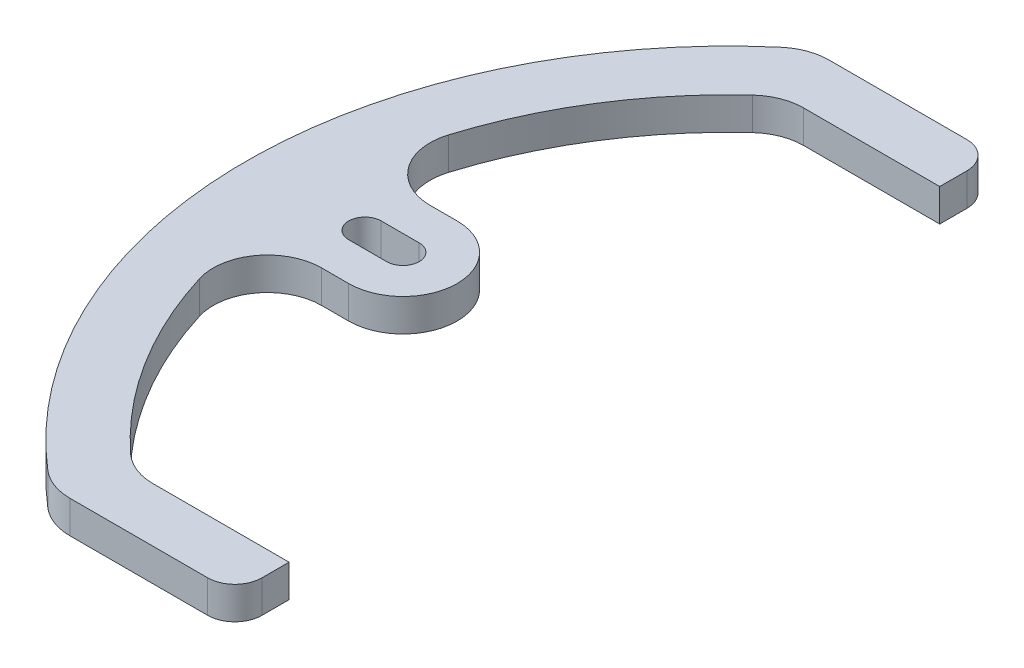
ISO-10303-21;
HEADER;
FILE_DESCRIPTION(('STEP AP214'),'2;1');
FILE_NAME('part.step','',(''),(''),'','','');
FILE_SCHEMA(('AUTOMOTIVE_DESIGN { 1 0 10303 214 1 1 1 1 }'));
ENDSEC;
DATA;
#1=APPLICATION_CONTEXT('core data for automotive mechanical design processes');
#2=APPLICATION_PROTOCOL_DEFINITION('international standard','automotive_design',2000,#1);
#3=PRODUCT_CONTEXT('',#1,'mechanical');
#4=PRODUCT('Part','Part','',(#3));
#5=PRODUCT_RELATED_PRODUCT_CATEGORY('part','',(#4));
#6=PRODUCT_DEFINITION_FORMATION('','',#4);
#7=PRODUCT_DEFINITION_CONTEXT('part definition',#1,'design');
#8=PRODUCT_DEFINITION('design','',#6,#7);
#9=PRODUCT_DEFINITION_SHAPE('','',#8);
#10=(LENGTH_UNIT() NAMED_UNIT(*) SI_UNIT(.MILLI.,.METRE.));
#11=(NAMED_UNIT(*) PLANE_ANGLE_UNIT() SI_UNIT($,.RADIAN.));
#12=(NAMED_UNIT(*) SI_UNIT($,.STERADIAN.) SOLID_ANGLE_UNIT());
#13=UNCERTAINTY_MEASURE_WITH_UNIT(LENGTH_MEASURE(1.E-05),#10,'distance_accuracy_value','');
#14=(GEOMETRIC_REPRESENTATION_CONTEXT(3) GLOBAL_UNCERTAINTY_ASSIGNED_CONTEXT((#13)) GLOBAL_UNIT_ASSIGNED_CONTEXT((#10,
#11,#12)) REPRESENTATION_CONTEXT('',''));
#15=CARTESIAN_POINT('',(0.,0.,0.));
#16=DIRECTION('',(0.,0.,1.));
#17=DIRECTION('',(1.,0.,0.));
#18=AXIS2_PLACEMENT_3D('',#15,#16,#17);
#19=CARTESIAN_POINT('',(-75.,6.,0.));
#20=DIRECTION('',(0.,1.,0.));
#21=DIRECTION('',(0.,0.,1.));
#22=AXIS2_PLACEMENT_3D('',#19,#20,#21);
#23=PLANE('',#22);
#24=CARTESIAN_POINT('',(-75.,6.,0.));
#25=DIRECTION('',(0.,1.,0.));
#26=DIRECTION('',(0.,0.,1.));
#27=AXIS2_PLACEMENT_3D('',#24,#25,#26);
#28=CIRCLE('',#27,9.99999999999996);
#29=CARTESIAN_POINT('',(-75.,6.,9.99999999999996));
#30=VERTEX_POINT('',#29);
#31=CARTESIAN_POINT('',(-75.,6.,-9.99999999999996));
#32=VERTEX_POINT('',#31);
#33=EDGE_CURVE('E274',#30,#32,#28,.T.);
#34=ORIENTED_EDGE('',*,*,#33,.T.);
#35=DIRECTION('',(-1.,0.,0.));
#36=VECTOR('',#35,1.);
#37=CARTESIAN_POINT('',(-75.,6.,-9.99999999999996));
#38=LINE('',#37,#36);
#39=CARTESIAN_POINT('',(-79.9923072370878,6.,-9.99999999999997));
#40=VERTEX_POINT('',#39);
#41=EDGE_CURVE('E277',#32,#40,#38,.T.);
#42=ORIENTED_EDGE('',*,*,#41,.T.);
#43=CARTESIAN_POINT('',(-79.9923072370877,6.,-20.));
#44=DIRECTION('',(0.,-1.,0.));
#45=DIRECTION('',(0.,0.,1.));
#46=AXIS2_PLACEMENT_3D('',#43,#44,#45);
#47=CIRCLE('',#46,10.);
#48=CARTESIAN_POINT('',(-89.5499994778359,6.,-22.9411764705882));
#49=VERTEX_POINT('',#48);
#50=EDGE_CURVE('E279',#40,#49,#47,.T.);
#51=ORIENTED_EDGE('',*,*,#50,.T.);
#52=CARTESIAN_POINT('',(-15.,6.,0.));
#53=DIRECTION('',(0.,-1.,0.));
#54=DIRECTION('',(0.,0.,-1.));
#55=AXIS2_PLACEMENT_3D('',#52,#53,#54);
#56=CIRCLE('',#55,78.);
#57=CARTESIAN_POINT('',(-67.8643560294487,6.,-57.3529411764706));
#58=VERTEX_POINT('',#57);
#59=EDGE_CURVE('E281',#49,#58,#56,.T.);
#60=ORIENTED_EDGE('',*,*,#59,.T.);
#61=CARTESIAN_POINT('',(-61.0868744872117,6.,-50.));
#62=DIRECTION('',(0.,-1.,0.));
#63=DIRECTION('',(0.,0.,-1.));
#64=AXIS2_PLACEMENT_3D('',#61,#62,#63);
#65=CIRCLE('',#64,10.);
#66=CARTESIAN_POINT('',(-61.0868744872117,6.,-60.));
#67=VERTEX_POINT('',#66);
#68=EDGE_CURVE('E283',#58,#67,#65,.T.);
#69=ORIENTED_EDGE('',*,*,#68,.T.);
#70=DIRECTION('',(1.,0.,0.));
#71=VECTOR('',#70,1.);
#72=CARTESIAN_POINT('',(-61.0868744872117,6.,-60.));
#73=LINE('',#72,#71);
#74=CARTESIAN_POINT('',(-36.,6.,-60.));
#75=VERTEX_POINT('',#74);
#76=EDGE_CURVE('E285',#67,#75,#73,.T.);
#77=ORIENTED_EDGE('',*,*,#76,.T.);
#78=DIRECTION('',(0.,0.,-1.));
#79=VECTOR('',#78,1.);
#80=CARTESIAN_POINT('',(-36.,6.,-60.));
#81=LINE('',#80,#79);
#82=CARTESIAN_POINT('',(-36.,6.,-65.));
#83=VERTEX_POINT('',#82);
#84=EDGE_CURVE('E287',#75,#83,#81,.T.);
#85=ORIENTED_EDGE('',*,*,#84,.T.);
#86=CARTESIAN_POINT('',(-41.,6.,-65.));
#87=DIRECTION('',(0.,1.,0.));
#88=DIRECTION('',(0.,0.,-1.));
#89=AXIS2_PLACEMENT_3D('',#86,#87,#88);
#90=CIRCLE('',#89,5.);
#91=CARTESIAN_POINT('',(-41.,6.,-70.));
#92=VERTEX_POINT('',#91);
#93=EDGE_CURVE('E289',#83,#92,#90,.T.);
#94=ORIENTED_EDGE('',*,*,#93,.T.);
#95=DIRECTION('',(-1.,0.,0.));
#96=VECTOR('',#95,1.);
#97=CARTESIAN_POINT('',(-66.3906606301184,6.,-70.));
#98=LINE('',#97,#96);
#99=CARTESIAN_POINT('',(-66.3906606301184,6.,-70.));
#100=VERTEX_POINT('',#99);
#101=EDGE_CURVE('E291',#92,#100,#98,.T.);
#102=ORIENTED_EDGE('',*,*,#101,.T.);
#103=CARTESIAN_POINT('',(-66.3906606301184,6.,-60.));
#104=DIRECTION('',(0.,1.,0.));
#105=DIRECTION('',(0.,0.,1.));
#106=AXIS2_PLACEMENT_3D('',#103,#104,#105);
#107=CIRCLE('',#106,10.);
#108=CARTESIAN_POINT('',(-72.8958075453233,6.,-67.5949367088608));
#109=VERTEX_POINT('',#108);
#110=EDGE_CURVE('E293',#100,#109,#107,.T.);
#111=ORIENTED_EDGE('',*,*,#110,.T.);
#112=CARTESIAN_POINT('',(-15.,6.,0.));
#113=DIRECTION('',(0.,1.,0.));
#114=DIRECTION('',(0.,0.,1.));
#115=AXIS2_PLACEMENT_3D('',#112,#113,#114);
#116=CIRCLE('',#115,89.0000000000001);
#117=CARTESIAN_POINT('',(-72.8958075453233,6.,67.5949367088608));
#118=VERTEX_POINT('',#117);
#119=EDGE_CURVE('E295',#109,#118,#116,.T.);
#120=ORIENTED_EDGE('',*,*,#119,.T.);
#121=CARTESIAN_POINT('',(-66.3906606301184,6.,60.));
#122=DIRECTION('',(0.,1.,0.));
#123=DIRECTION('',(0.,0.,-1.));
#124=AXIS2_PLACEMENT_3D('',#121,#122,#123);
#125=CIRCLE('',#124,10.);
#126=CARTESIAN_POINT('',(-66.3906606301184,6.,70.));
#127=VERTEX_POINT('',#126);
#128=EDGE_CURVE('E297',#118,#127,#125,.T.);
#129=ORIENTED_EDGE('',*,*,#128,.T.);
#130=DIRECTION('',(1.,0.,0.));
#131=VECTOR('',#130,1.);
#132=CARTESIAN_POINT('',(-66.3906606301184,6.,70.));
#133=LINE('',#132,#131);
#134=CARTESIAN_POINT('',(-41.,6.,70.));
#135=VERTEX_POINT('',#134);
#136=EDGE_CURVE('E299',#127,#135,#133,.T.);
#137=ORIENTED_EDGE('',*,*,#136,.T.);
#138=CARTESIAN_POINT('',(-41.,6.,65.));
#139=DIRECTION('',(0.,1.,0.));
#140=DIRECTION('',(0.,0.,1.));
#141=AXIS2_PLACEMENT_3D('',#138,#139,#140);
#142=CIRCLE('',#141,5.);
#143=CARTESIAN_POINT('',(-36.,6.,65.));
#144=VERTEX_POINT('',#143);
#145=EDGE_CURVE('E301',#135,#144,#142,.T.);
#146=ORIENTED_EDGE('',*,*,#145,.T.);
#147=DIRECTION('',(0.,0.,-1.));
#148=VECTOR('',#147,1.);
#149=CARTESIAN_POINT('',(-36.,6.,60.));
#150=LINE('',#149,#148);
#151=CARTESIAN_POINT('',(-36.,6.,60.));
#152=VERTEX_POINT('',#151);
#153=EDGE_CURVE('E303',#144,#152,#150,.T.);
#154=ORIENTED_EDGE('',*,*,#153,.T.);
#155=DIRECTION('',(-1.,0.,0.));
#156=VECTOR('',#155,1.);
#157=CARTESIAN_POINT('',(-61.0868744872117,6.,60.));
#158=LINE('',#157,#156);
#159=CARTESIAN_POINT('',(-61.0868744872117,6.,60.));
#160=VERTEX_POINT('',#159);
#161=EDGE_CURVE('E305',#152,#160,#158,.T.);
#162=ORIENTED_EDGE('',*,*,#161,.T.);
#163=CARTESIAN_POINT('',(-61.0868744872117,6.,50.));
#164=DIRECTION('',(0.,-1.,0.));
#165=DIRECTION('',(0.,0.,1.));
#166=AXIS2_PLACEMENT_3D('',#163,#164,#165);
#167=CIRCLE('',#166,10.);
#168=CARTESIAN_POINT('',(-67.8643560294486,6.,57.3529411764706));
#169=VERTEX_POINT('',#168);
#170=EDGE_CURVE('E307',#160,#169,#167,.T.);
#171=ORIENTED_EDGE('',*,*,#170,.T.);
#172=CARTESIAN_POINT('',(-15.,6.,0.));
#173=DIRECTION('',(0.,-1.,0.));
#174=DIRECTION('',(0.,0.,1.));
#175=AXIS2_PLACEMENT_3D('',#172,#173,#174);
#176=CIRCLE('',#175,78.);
#177=CARTESIAN_POINT('',(-89.5499994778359,6.,22.9411764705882));
#178=VERTEX_POINT('',#177);
#179=EDGE_CURVE('E309',#169,#178,#176,.T.);
#180=ORIENTED_EDGE('',*,*,#179,.T.);
#181=CARTESIAN_POINT('',(-79.9923072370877,6.,20.));
#182=DIRECTION('',(0.,-1.,0.));
#183=DIRECTION('',(0.,0.,-1.));
#184=AXIS2_PLACEMENT_3D('',#181,#182,#183);
#185=CIRCLE('',#184,10.);
#186=CARTESIAN_POINT('',(-79.9923072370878,6.,9.99999999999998));
#187=VERTEX_POINT('',#186);
#188=EDGE_CURVE('E311',#178,#187,#185,.T.);
#189=ORIENTED_EDGE('',*,*,#188,.T.);
#190=DIRECTION('',(1.,0.,0.));
#191=VECTOR('',#190,1.);
#192=CARTESIAN_POINT('',(-75.,6.,9.99999999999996));
#193=LINE('',#192,#191);
#194=EDGE_CURVE('E313',#187,#30,#193,.T.);
#195=ORIENTED_EDGE('',*,*,#194,.T.);
#196=EDGE_LOOP('',(#34,#42,#51,#60,#69,#77,#85,#94,#102,#111,#120,#129,#137,#146,#154,#162,#171,
#180,#189,#195));
#197=FACE_BOUND('',#196,.T.);
#198=DIRECTION('',(-1.,0.,0.));
#199=VECTOR('',#198,1.);
#200=CARTESIAN_POINT('',(-82.,6.,-3.00000000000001));
#201=LINE('',#200,#199);
#202=CARTESIAN_POINT('',(-75.,6.,-3.00000000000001));
#203=VERTEX_POINT('',#202);
#204=CARTESIAN_POINT('',(-82.,6.,-3.00000000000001));
#205=VERTEX_POINT('',#204);
#206=EDGE_CURVE('E224',#203,#205,#201,.T.);
#207=ORIENTED_EDGE('',*,*,#206,.F.);
#208=CARTESIAN_POINT('',(-75.,6.,0.));
#209=DIRECTION('',(0.,1.,0.));
#210=DIRECTION('',(0.,0.,1.));
#211=AXIS2_PLACEMENT_3D('',#208,#209,#210);
#212=CIRCLE('',#211,3.00000000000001);
#213=CARTESIAN_POINT('',(-75.,6.,3.00000000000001));
#214=VERTEX_POINT('',#213);
#215=EDGE_CURVE('E213',#214,#203,#212,.T.);
#216=ORIENTED_EDGE('',*,*,#215,.F.);
#217=DIRECTION('',(1.,0.,0.));
#218=VECTOR('',#217,1.);
#219=CARTESIAN_POINT('',(-75.,6.,3.00000000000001));
#220=LINE('',#219,#218);
#221=CARTESIAN_POINT('',(-82.,6.,3.00000000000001));
#222=VERTEX_POINT('',#221);
#223=EDGE_CURVE('E228',#222,#214,#220,.T.);
#224=ORIENTED_EDGE('',*,*,#223,.F.);
#225=CARTESIAN_POINT('',(-82.,6.,0.));
#226=DIRECTION('',(0.,1.,0.));
#227=DIRECTION('',(0.,0.,1.));
#228=AXIS2_PLACEMENT_3D('',#225,#226,#227);
#229=CIRCLE('',#228,3.00000000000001);
#230=EDGE_CURVE('E226',#205,#222,#229,.T.);
#231=ORIENTED_EDGE('',*,*,#230,.F.);
#232=EDGE_LOOP('',(#207,#216,#224,#231));
#233=FACE_BOUND('',#232,.T.);
#234=ADVANCED_FACE('F37',(#197,#233),#23,.T.);
#235=CARTESIAN_POINT('',(-75.,0.,0.));
#236=DIRECTION('',(0.,1.,0.));
#237=DIRECTION('',(0.,0.,1.));
#238=AXIS2_PLACEMENT_3D('',#235,#236,#237);
#239=PLANE('',#238);
#240=CARTESIAN_POINT('',(-75.,0.,0.));
#241=DIRECTION('',(0.,1.,0.));
#242=DIRECTION('',(0.,0.,1.));
#243=AXIS2_PLACEMENT_3D('',#240,#241,#242);
#244=CIRCLE('',#243,9.99999999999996);
#245=CARTESIAN_POINT('',(-75.,0.,9.99999999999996));
#246=VERTEX_POINT('',#245);
#247=CARTESIAN_POINT('',(-75.,0.,-9.99999999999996));
#248=VERTEX_POINT('',#247);
#249=EDGE_CURVE('E214',#246,#248,#244,.T.);
#250=ORIENTED_EDGE('',*,*,#249,.F.);
#251=DIRECTION('',(1.,0.,0.));
#252=VECTOR('',#251,1.);
#253=CARTESIAN_POINT('',(-75.,0.,9.99999999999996));
#254=LINE('',#253,#252);
#255=CARTESIAN_POINT('',(-79.9923072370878,0.,9.99999999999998));
#256=VERTEX_POINT('',#255);
#257=EDGE_CURVE('E272',#256,#246,#254,.T.);
#258=ORIENTED_EDGE('',*,*,#257,.F.);
#259=CARTESIAN_POINT('',(-79.9923072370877,0.,20.));
#260=DIRECTION('',(0.,-1.,0.));
#261=DIRECTION('',(0.,0.,-1.));
#262=AXIS2_PLACEMENT_3D('',#259,#260,#261);
#263=CIRCLE('',#262,10.);
#264=CARTESIAN_POINT('',(-89.5499994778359,0.,22.9411764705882));
#265=VERTEX_POINT('',#264);
#266=EDGE_CURVE('E270',#265,#256,#263,.T.);
#267=ORIENTED_EDGE('',*,*,#266,.F.);
#268=CARTESIAN_POINT('',(-15.,0.,0.));
#269=DIRECTION('',(0.,-1.,0.));
#270=DIRECTION('',(0.,0.,1.));
#271=AXIS2_PLACEMENT_3D('',#268,#269,#270);
#272=CIRCLE('',#271,78.);
#273=CARTESIAN_POINT('',(-67.8643560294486,0.,57.3529411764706));
#274=VERTEX_POINT('',#273);
#275=EDGE_CURVE('E268',#274,#265,#272,.T.);
#276=ORIENTED_EDGE('',*,*,#275,.F.);
#277=CARTESIAN_POINT('',(-61.0868744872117,0.,50.));
#278=DIRECTION('',(0.,-1.,0.));
#279=DIRECTION('',(0.,0.,1.));
#280=AXIS2_PLACEMENT_3D('',#277,#278,#279);
#281=CIRCLE('',#280,10.);
#282=CARTESIAN_POINT('',(-61.0868744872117,0.,60.));
#283=VERTEX_POINT('',#282);
#284=EDGE_CURVE('E266',#283,#274,#281,.T.);
#285=ORIENTED_EDGE('',*,*,#284,.F.);
#286=DIRECTION('',(-1.,0.,0.));
#287=VECTOR('',#286,1.);
#288=CARTESIAN_POINT('',(-61.0868744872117,0.,60.));
#289=LINE('',#288,#287);
#290=CARTESIAN_POINT('',(-36.,0.,60.));
#291=VERTEX_POINT('',#290);
#292=EDGE_CURVE('E264',#291,#283,#289,.T.);
#293=ORIENTED_EDGE('',*,*,#292,.F.);
#294=DIRECTION('',(0.,0.,-1.));
#295=VECTOR('',#294,1.);
#296=CARTESIAN_POINT('',(-36.,0.,60.));
#297=LINE('',#296,#295);
#298=CARTESIAN_POINT('',(-36.,0.,65.));
#299=VERTEX_POINT('',#298);
#300=EDGE_CURVE('E262',#299,#291,#297,.T.);
#301=ORIENTED_EDGE('',*,*,#300,.F.);
#302=CARTESIAN_POINT('',(-41.,0.,65.));
#303=DIRECTION('',(0.,1.,0.));
#304=DIRECTION('',(0.,0.,1.));
#305=AXIS2_PLACEMENT_3D('',#302,#303,#304);
#306=CIRCLE('',#305,5.);
#307=CARTESIAN_POINT('',(-41.,0.,70.));
#308=VERTEX_POINT('',#307);
#309=EDGE_CURVE('E260',#308,#299,#306,.T.);
#310=ORIENTED_EDGE('',*,*,#309,.F.);
#311=DIRECTION('',(1.,0.,0.));
#312=VECTOR('',#311,1.);
#313=CARTESIAN_POINT('',(-66.3906606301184,0.,70.));
#314=LINE('',#313,#312);
#315=CARTESIAN_POINT('',(-66.3906606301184,0.,70.));
#316=VERTEX_POINT('',#315);
#317=EDGE_CURVE('E258',#316,#308,#314,.T.);
#318=ORIENTED_EDGE('',*,*,#317,.F.);
#319=CARTESIAN_POINT('',(-66.3906606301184,0.,60.));
#320=DIRECTION('',(0.,1.,0.));
#321=DIRECTION('',(0.,0.,-1.));
#322=AXIS2_PLACEMENT_3D('',#319,#320,#321);
#323=CIRCLE('',#322,10.);
#324=CARTESIAN_POINT('',(-72.8958075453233,0.,67.5949367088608));
#325=VERTEX_POINT('',#324);
#326=EDGE_CURVE('E256',#325,#316,#323,.T.);
#327=ORIENTED_EDGE('',*,*,#326,.F.);
#328=CARTESIAN_POINT('',(-15.,0.,0.));
#329=DIRECTION('',(0.,1.,0.));
#330=DIRECTION('',(0.,0.,1.));
#331=AXIS2_PLACEMENT_3D('',#328,#329,#330);
#332=CIRCLE('',#331,89.0000000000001);
#333=CARTESIAN_POINT('',(-72.8958075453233,0.,-67.5949367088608));
#334=VERTEX_POINT('',#333);
#335=EDGE_CURVE('E254',#334,#325,#332,.T.);
#336=ORIENTED_EDGE('',*,*,#335,.F.);
#337=CARTESIAN_POINT('',(-66.3906606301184,0.,-60.));
#338=DIRECTION('',(0.,1.,0.));
#339=DIRECTION('',(0.,0.,1.));
#340=AXIS2_PLACEMENT_3D('',#337,#338,#339);
#341=CIRCLE('',#340,10.);
#342=CARTESIAN_POINT('',(-66.3906606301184,0.,-70.));
#343=VERTEX_POINT('',#342);
#344=EDGE_CURVE('E252',#343,#334,#341,.T.);
#345=ORIENTED_EDGE('',*,*,#344,.F.);
#346=DIRECTION('',(-1.,0.,0.));
#347=VECTOR('',#346,1.);
#348=CARTESIAN_POINT('',(-66.3906606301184,0.,-70.));
#349=LINE('',#348,#347);
#350=CARTESIAN_POINT('',(-41.,0.,-70.));
#351=VERTEX_POINT('',#350);
#352=EDGE_CURVE('E250',#351,#343,#349,.T.);
#353=ORIENTED_EDGE('',*,*,#352,.F.);
#354=CARTESIAN_POINT('',(-41.,0.,-65.));
#355=DIRECTION('',(0.,1.,0.));
#356=DIRECTION('',(0.,0.,-1.));
#357=AXIS2_PLACEMENT_3D('',#354,#355,#356);
#358=CIRCLE('',#357,5.);
#359=CARTESIAN_POINT('',(-36.,0.,-65.));
#360=VERTEX_POINT('',#359);
#361=EDGE_CURVE('E248',#360,#351,#358,.T.);
#362=ORIENTED_EDGE('',*,*,#361,.F.);
#363=DIRECTION('',(0.,0.,-1.));
#364=VECTOR('',#363,1.);
#365=CARTESIAN_POINT('',(-36.,0.,-60.));
#366=LINE('',#365,#364);
#367=CARTESIAN_POINT('',(-36.,0.,-60.));
#368=VERTEX_POINT('',#367);
#369=EDGE_CURVE('E246',#368,#360,#366,.T.);
#370=ORIENTED_EDGE('',*,*,#369,.F.);
#371=DIRECTION('',(1.,0.,0.));
#372=VECTOR('',#371,1.);
#373=CARTESIAN_POINT('',(-61.0868744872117,0.,-60.));
#374=LINE('',#373,#372);
#375=CARTESIAN_POINT('',(-61.0868744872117,0.,-60.));
#376=VERTEX_POINT('',#375);
#377=EDGE_CURVE('E244',#376,#368,#374,.T.);
#378=ORIENTED_EDGE('',*,*,#377,.F.);
#379=CARTESIAN_POINT('',(-61.0868744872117,0.,-50.));
#380=DIRECTION('',(0.,-1.,0.));
#381=DIRECTION('',(0.,0.,-1.));
#382=AXIS2_PLACEMENT_3D('',#379,#380,#381);
#383=CIRCLE('',#382,10.);
#384=CARTESIAN_POINT('',(-67.8643560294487,0.,-57.3529411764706));
#385=VERTEX_POINT('',#384);
#386=EDGE_CURVE('E242',#385,#376,#383,.T.);
#387=ORIENTED_EDGE('',*,*,#386,.F.);
#388=CARTESIAN_POINT('',(-15.,0.,0.));
#389=DIRECTION('',(0.,-1.,0.));
#390=DIRECTION('',(0.,0.,-1.));
#391=AXIS2_PLACEMENT_3D('',#388,#389,#390);
#392=CIRCLE('',#391,78.);
#393=CARTESIAN_POINT('',(-89.5499994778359,0.,-22.9411764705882));
#394=VERTEX_POINT('',#393);
#395=EDGE_CURVE('E240',#394,#385,#392,.T.);
#396=ORIENTED_EDGE('',*,*,#395,.F.);
#397=CARTESIAN_POINT('',(-79.9923072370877,0.,-20.));
#398=DIRECTION('',(0.,-1.,0.));
#399=DIRECTION('',(0.,0.,1.));
#400=AXIS2_PLACEMENT_3D('',#397,#398,#399);
#401=CIRCLE('',#400,10.);
#402=CARTESIAN_POINT('',(-79.9923072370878,0.,-9.99999999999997));
#403=VERTEX_POINT('',#402);
#404=EDGE_CURVE('E238',#403,#394,#401,.T.);
#405=ORIENTED_EDGE('',*,*,#404,.F.);
#406=DIRECTION('',(-1.,0.,0.));
#407=VECTOR('',#406,1.);
#408=CARTESIAN_POINT('',(-75.,0.,-9.99999999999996));
#409=LINE('',#408,#407);
#410=EDGE_CURVE('E236',#248,#403,#409,.T.);
#411=ORIENTED_EDGE('',*,*,#410,.F.);
#412=EDGE_LOOP('',(#250,#258,#267,#276,#285,#293,#301,#310,#318,#327,#336,#345,#353,#362,#370,
#378,#387,#396,#405,#411));
#413=FACE_BOUND('',#412,.T.);
#414=CARTESIAN_POINT('',(-75.,0.,0.));
#415=DIRECTION('',(0.,1.,0.));
#416=DIRECTION('',(0.,0.,1.));
#417=AXIS2_PLACEMENT_3D('',#414,#415,#416);
#418=CIRCLE('',#417,3.00000000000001);
#419=CARTESIAN_POINT('',(-75.,0.,3.00000000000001));
#420=VERTEX_POINT('',#419);
#421=CARTESIAN_POINT('',(-75.,0.,-3.00000000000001));
#422=VERTEX_POINT('',#421);
#423=EDGE_CURVE('E60',#420,#422,#418,.T.);
#424=ORIENTED_EDGE('',*,*,#423,.T.);
#425=DIRECTION('',(-1.,0.,0.));
#426=VECTOR('',#425,1.);
#427=CARTESIAN_POINT('',(-82.,0.,-3.00000000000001));
#428=LINE('',#427,#426);
#429=CARTESIAN_POINT('',(-82.,0.,-3.00000000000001));
#430=VERTEX_POINT('',#429);
#431=EDGE_CURVE('E200',#422,#430,#428,.T.);
#432=ORIENTED_EDGE('',*,*,#431,.T.);
#433=CARTESIAN_POINT('',(-82.,0.,0.));
#434=DIRECTION('',(0.,1.,0.));
#435=DIRECTION('',(0.,0.,1.));
#436=AXIS2_PLACEMENT_3D('',#433,#434,#435);
#437=CIRCLE('',#436,3.00000000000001);
#438=CARTESIAN_POINT('',(-82.,0.,3.00000000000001));
#439=VERTEX_POINT('',#438);
#440=EDGE_CURVE('E209',#430,#439,#437,.T.);
#441=ORIENTED_EDGE('',*,*,#440,.T.);
#442=DIRECTION('',(1.,0.,0.));
#443=VECTOR('',#442,1.);
#444=CARTESIAN_POINT('',(-75.,0.,3.00000000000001));
#445=LINE('',#444,#443);
#446=EDGE_CURVE('E218',#439,#420,#445,.T.);
#447=ORIENTED_EDGE('',*,*,#446,.T.);
#448=EDGE_LOOP('',(#424,#432,#441,#447));
#449=FACE_BOUND('',#448,.T.);
#450=ADVANCED_FACE('F217',(#413,#449),#239,.F.);
#451=CARTESIAN_POINT('',(-75.,6.,0.));
#452=DIRECTION('',(0.,-1.,0.));
#453=DIRECTION('',(0.,0.,-1.));
#454=AXIS2_PLACEMENT_3D('',#451,#452,#453);
#455=CYLINDRICAL_SURFACE('',#454,9.99999999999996);
#456=ORIENTED_EDGE('',*,*,#249,.T.);
#457=DIRECTION('',(0.,-1.,0.));
#458=VECTOR('',#457,1.);
#459=CARTESIAN_POINT('',(-75.,6.,-9.99999999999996));
#460=LINE('',#459,#458);
#461=EDGE_CURVE('E11',#32,#248,#460,.T.);
#462=ORIENTED_EDGE('',*,*,#461,.F.);
#463=ORIENTED_EDGE('',*,*,#33,.F.);
#464=DIRECTION('',(0.,-1.,0.));
#465=VECTOR('',#464,1.);
#466=CARTESIAN_POINT('',(-75.,6.,9.99999999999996));
#467=LINE('',#466,#465);
#468=EDGE_CURVE('E315',#30,#246,#467,.T.);
#469=ORIENTED_EDGE('',*,*,#468,.T.);
#470=EDGE_LOOP('',(#456,#462,#463,#469));
#471=FACE_BOUND('',#470,.T.);
#472=ADVANCED_FACE('F39',(#471),#455,.T.);
#473=CARTESIAN_POINT('',(-75.,6.,-9.99999999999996));
#474=DIRECTION('',(0.,0.,1.));
#475=DIRECTION('',(1.,0.,0.));
#476=AXIS2_PLACEMENT_3D('',#473,#474,#475);
#477=PLANE('',#476);
#478=ORIENTED_EDGE('',*,*,#410,.T.);
#479=DIRECTION('',(0.,-1.,0.));
#480=VECTOR('',#479,1.);
#481=CARTESIAN_POINT('',(-79.9923072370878,6.,-9.99999999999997));
#482=LINE('',#481,#480);
#483=EDGE_CURVE('E45',#40,#403,#482,.T.);
#484=ORIENTED_EDGE('',*,*,#483,.F.);
#485=ORIENTED_EDGE('',*,*,#41,.F.);
#486=ORIENTED_EDGE('',*,*,#461,.T.);
#487=EDGE_LOOP('',(#478,#484,#485,#486));
#488=FACE_BOUND('',#487,.T.);
#489=ADVANCED_FACE('F395',(#488),#477,.F.);
#490=CARTESIAN_POINT('',(-79.9923072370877,6.,-20.));
#491=DIRECTION('',(0.,-1.,0.));
#492=DIRECTION('',(0.,0.,-1.));
#493=AXIS2_PLACEMENT_3D('',#490,#491,#492);
#494=CYLINDRICAL_SURFACE('',#493,10.);
#495=ORIENTED_EDGE('',*,*,#404,.T.);
#496=DIRECTION('',(0.,-1.,0.));
#497=VECTOR('',#496,1.);
#498=CARTESIAN_POINT('',(-89.5499994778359,6.,-22.9411764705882));
#499=LINE('',#498,#497);
#500=EDGE_CURVE('E366',#49,#394,#499,.T.);
#501=ORIENTED_EDGE('',*,*,#500,.F.);
#502=ORIENTED_EDGE('',*,*,#50,.F.);
#503=ORIENTED_EDGE('',*,*,#483,.T.);
#504=EDGE_LOOP('',(#495,#501,#502,#503));
#505=FACE_BOUND('',#504,.T.);
#506=ADVANCED_FACE('F373',(#505),#494,.F.);
#507=CARTESIAN_POINT('',(-15.,6.,0.));
#508=DIRECTION('',(0.,-1.,0.));
#509=DIRECTION('',(0.,0.,-1.));
#510=AXIS2_PLACEMENT_3D('',#507,#508,#509);
#511=CYLINDRICAL_SURFACE('',#510,78.);
#512=ORIENTED_EDGE('',*,*,#395,.T.);
#513=DIRECTION('',(0.,-1.,0.));
#514=VECTOR('',#513,1.);
#515=CARTESIAN_POINT('',(-67.8643560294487,6.,-57.3529411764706));
#516=LINE('',#515,#514);
#517=EDGE_CURVE('E363',#58,#385,#516,.T.);
#518=ORIENTED_EDGE('',*,*,#517,.F.);
#519=ORIENTED_EDGE('',*,*,#59,.F.);
#520=ORIENTED_EDGE('',*,*,#500,.T.);
#521=EDGE_LOOP('',(#512,#518,#519,#520));
#522=FACE_BOUND('',#521,.T.);
#523=ADVANCED_FACE('F383',(#522),#511,.F.);
#524=CARTESIAN_POINT('',(-61.0868744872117,6.,-50.));
#525=DIRECTION('',(0.,-1.,0.));
#526=DIRECTION('',(0.,0.,-1.));
#527=AXIS2_PLACEMENT_3D('',#524,#525,#526);
#528=CYLINDRICAL_SURFACE('',#527,10.);
#529=ORIENTED_EDGE('',*,*,#386,.T.);
#530=DIRECTION('',(0.,-1.,0.));
#531=VECTOR('',#530,1.);
#532=CARTESIAN_POINT('',(-61.0868744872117,6.,-60.));
#533=LINE('',#532,#531);
#534=EDGE_CURVE('E360',#67,#376,#533,.T.);
#535=ORIENTED_EDGE('',*,*,#534,.F.);
#536=ORIENTED_EDGE('',*,*,#68,.F.);
#537=ORIENTED_EDGE('',*,*,#517,.T.);
#538=EDGE_LOOP('',(#529,#535,#536,#537));
#539=FACE_BOUND('',#538,.T.);
#540=ADVANCED_FACE('F387',(#539),#528,.F.);
#541=CARTESIAN_POINT('',(-61.0868744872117,6.,-60.));
#542=DIRECTION('',(0.,0.,-1.));
#543=DIRECTION('',(-1.,0.,0.));
#544=AXIS2_PLACEMENT_3D('',#541,#542,#543);
#545=PLANE('',#544);
#546=ORIENTED_EDGE('',*,*,#377,.T.);
#547=DIRECTION('',(0.,-1.,0.));
#548=VECTOR('',#547,1.);
#549=CARTESIAN_POINT('',(-36.,6.,-60.));
#550=LINE('',#549,#548);
#551=EDGE_CURVE('E357',#75,#368,#550,.T.);
#552=ORIENTED_EDGE('',*,*,#551,.F.);
#553=ORIENTED_EDGE('',*,*,#76,.F.);
#554=ORIENTED_EDGE('',*,*,#534,.T.);
#555=EDGE_LOOP('',(#546,#552,#553,#554));
#556=FACE_BOUND('',#555,.T.);
#557=ADVANCED_FACE('F468',(#556),#545,.F.);
#558=CARTESIAN_POINT('',(-36.,6.,-60.));
#559=DIRECTION('',(-1.,0.,0.));
#560=DIRECTION('',(0.,0.,1.));
#561=AXIS2_PLACEMENT_3D('',#558,#559,#560);
#562=PLANE('',#561);
#563=ORIENTED_EDGE('',*,*,#369,.T.);
#564=DIRECTION('',(0.,-1.,0.));
#565=VECTOR('',#564,1.);
#566=CARTESIAN_POINT('',(-36.,6.,-65.));
#567=LINE('',#566,#565);
#568=EDGE_CURVE('E354',#83,#360,#567,.T.);
#569=ORIENTED_EDGE('',*,*,#568,.F.);
#570=ORIENTED_EDGE('',*,*,#84,.F.);
#571=ORIENTED_EDGE('',*,*,#551,.T.);
#572=EDGE_LOOP('',(#563,#569,#570,#571));
#573=FACE_BOUND('',#572,.T.);
#574=ADVANCED_FACE('F466',(#573),#562,.F.);
#575=CARTESIAN_POINT('',(-41.,6.,-65.));
#576=DIRECTION('',(0.,-1.,0.));
#577=DIRECTION('',(0.,0.,-1.));
#578=AXIS2_PLACEMENT_3D('',#575,#576,#577);
#579=CYLINDRICAL_SURFACE('',#578,5.);
#580=ORIENTED_EDGE('',*,*,#361,.T.);
#581=DIRECTION('',(0.,-1.,0.));
#582=VECTOR('',#581,1.);
#583=CARTESIAN_POINT('',(-41.,6.,-70.));
#584=LINE('',#583,#582);
#585=EDGE_CURVE('E351',#92,#351,#584,.T.);
#586=ORIENTED_EDGE('',*,*,#585,.F.);
#587=ORIENTED_EDGE('',*,*,#93,.F.);
#588=ORIENTED_EDGE('',*,*,#568,.T.);
#589=EDGE_LOOP('',(#580,#586,#587,#588));
#590=FACE_BOUND('',#589,.T.);
#591=ADVANCED_FACE('F461',(#590),#579,.T.);
#592=CARTESIAN_POINT('',(-66.3906606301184,6.,-70.));
#593=DIRECTION('',(0.,0.,1.));
#594=DIRECTION('',(1.,0.,0.));
#595=AXIS2_PLACEMENT_3D('',#592,#593,#594);
#596=PLANE('',#595);
#597=ORIENTED_EDGE('',*,*,#352,.T.);
#598=DIRECTION('',(0.,-1.,0.));
#599=VECTOR('',#598,1.);
#600=CARTESIAN_POINT('',(-66.3906606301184,6.,-70.));
#601=LINE('',#600,#599);
#602=EDGE_CURVE('E348',#100,#343,#601,.T.);
#603=ORIENTED_EDGE('',*,*,#602,.F.);
#604=ORIENTED_EDGE('',*,*,#101,.F.);
#605=ORIENTED_EDGE('',*,*,#585,.T.);
#606=EDGE_LOOP('',(#597,#603,#604,#605));
#607=FACE_BOUND('',#606,.T.);
#608=ADVANCED_FACE('F456',(#607),#596,.F.);
#609=CARTESIAN_POINT('',(-66.3906606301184,6.,-60.));
#610=DIRECTION('',(0.,-1.,0.));
#611=DIRECTION('',(0.,0.,-1.));
#612=AXIS2_PLACEMENT_3D('',#609,#610,#611);
#613=CYLINDRICAL_SURFACE('',#612,10.);
#614=ORIENTED_EDGE('',*,*,#344,.T.);
#615=DIRECTION('',(0.,-1.,0.));
#616=VECTOR('',#615,1.);
#617=CARTESIAN_POINT('',(-72.8958075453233,6.,-67.5949367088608));
#618=LINE('',#617,#616);
#619=EDGE_CURVE('E345',#109,#334,#618,.T.);
#620=ORIENTED_EDGE('',*,*,#619,.F.);
#621=ORIENTED_EDGE('',*,*,#110,.F.);
#622=ORIENTED_EDGE('',*,*,#602,.T.);
#623=EDGE_LOOP('',(#614,#620,#621,#622));
#624=FACE_BOUND('',#623,.T.);
#625=ADVANCED_FACE('F452',(#624),#613,.T.);
#626=CARTESIAN_POINT('',(-15.,6.,0.));
#627=DIRECTION('',(0.,-1.,0.));
#628=DIRECTION('',(0.,0.,-1.));
#629=AXIS2_PLACEMENT_3D('',#626,#627,#628);
#630=CYLINDRICAL_SURFACE('',#629,89.0000000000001);
#631=ORIENTED_EDGE('',*,*,#335,.T.);
#632=DIRECTION('',(0.,-1.,0.));
#633=VECTOR('',#632,1.);
#634=CARTESIAN_POINT('',(-72.8958075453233,6.,67.5949367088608));
#635=LINE('',#634,#633);
#636=EDGE_CURVE('E342',#118,#325,#635,.T.);
#637=ORIENTED_EDGE('',*,*,#636,.F.);
#638=ORIENTED_EDGE('',*,*,#119,.F.);
#639=ORIENTED_EDGE('',*,*,#619,.T.);
#640=EDGE_LOOP('',(#631,#637,#638,#639));
#641=FACE_BOUND('',#640,.T.);
#642=ADVANCED_FACE('F447',(#641),#630,.T.);
#643=CARTESIAN_POINT('',(-66.3906606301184,6.,60.));
#644=DIRECTION('',(0.,-1.,0.));
#645=DIRECTION('',(0.,0.,-1.));
#646=AXIS2_PLACEMENT_3D('',#643,#644,#645);
#647=CYLINDRICAL_SURFACE('',#646,10.);
#648=ORIENTED_EDGE('',*,*,#326,.T.);
#649=DIRECTION('',(0.,-1.,0.));
#650=VECTOR('',#649,1.);
#651=CARTESIAN_POINT('',(-66.3906606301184,6.,70.));
#652=LINE('',#651,#650);
#653=EDGE_CURVE('E339',#127,#316,#652,.T.);
#654=ORIENTED_EDGE('',*,*,#653,.F.);
#655=ORIENTED_EDGE('',*,*,#128,.F.);
#656=ORIENTED_EDGE('',*,*,#636,.T.);
#657=EDGE_LOOP('',(#648,#654,#655,#656));
#658=FACE_BOUND('',#657,.T.);
#659=ADVANCED_FACE('F441',(#658),#647,.T.);
#660=CARTESIAN_POINT('',(-66.3906606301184,6.,70.));
#661=DIRECTION('',(0.,0.,-1.));
#662=DIRECTION('',(-1.,0.,0.));
#663=AXIS2_PLACEMENT_3D('',#660,#661,#662);
#664=PLANE('',#663);
#665=ORIENTED_EDGE('',*,*,#317,.T.);
#666=DIRECTION('',(0.,-1.,0.));
#667=VECTOR('',#666,1.);
#668=CARTESIAN_POINT('',(-41.,6.,70.));
#669=LINE('',#668,#667);
#670=EDGE_CURVE('E336',#135,#308,#669,.T.);
#671=ORIENTED_EDGE('',*,*,#670,.F.);
#672=ORIENTED_EDGE('',*,*,#136,.F.);
#673=ORIENTED_EDGE('',*,*,#653,.T.);
#674=EDGE_LOOP('',(#665,#671,#672,#673));
#675=FACE_BOUND('',#674,.T.);
#676=ADVANCED_FACE('F437',(#675),#664,.F.);
#677=CARTESIAN_POINT('',(-41.,6.,65.));
#678=DIRECTION('',(0.,-1.,0.));
#679=DIRECTION('',(0.,0.,-1.));
#680=AXIS2_PLACEMENT_3D('',#677,#678,#679);
#681=CYLINDRICAL_SURFACE('',#680,5.);
#682=ORIENTED_EDGE('',*,*,#309,.T.);
#683=DIRECTION('',(0.,-1.,0.));
#684=VECTOR('',#683,1.);
#685=CARTESIAN_POINT('',(-36.,6.,65.));
#686=LINE('',#685,#684);
#687=EDGE_CURVE('E333',#144,#299,#686,.T.);
#688=ORIENTED_EDGE('',*,*,#687,.F.);
#689=ORIENTED_EDGE('',*,*,#145,.F.);
#690=ORIENTED_EDGE('',*,*,#670,.T.);
#691=EDGE_LOOP('',(#682,#688,#689,#690));
#692=FACE_BOUND('',#691,.T.);
#693=ADVANCED_FACE('F432',(#692),#681,.T.);
#694=CARTESIAN_POINT('',(-36.,6.,60.));
#695=DIRECTION('',(-1.,0.,0.));
#696=DIRECTION('',(0.,0.,1.));
#697=AXIS2_PLACEMENT_3D('',#694,#695,#696);
#698=PLANE('',#697);
#699=ORIENTED_EDGE('',*,*,#300,.T.);
#700=DIRECTION('',(0.,-1.,0.));
#701=VECTOR('',#700,1.);
#702=CARTESIAN_POINT('',(-36.,6.,60.));
#703=LINE('',#702,#701);
#704=EDGE_CURVE('E330',#152,#291,#703,.T.);
#705=ORIENTED_EDGE('',*,*,#704,.F.);
#706=ORIENTED_EDGE('',*,*,#153,.F.);
#707=ORIENTED_EDGE('',*,*,#687,.T.);
#708=EDGE_LOOP('',(#699,#705,#706,#707));
#709=FACE_BOUND('',#708,.T.);
#710=ADVANCED_FACE('F426',(#709),#698,.F.);
#711=CARTESIAN_POINT('',(-61.0868744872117,6.,60.));
#712=DIRECTION('',(0.,0.,1.));
#713=DIRECTION('',(1.,0.,0.));
#714=AXIS2_PLACEMENT_3D('',#711,#712,#713);
#715=PLANE('',#714);
#716=ORIENTED_EDGE('',*,*,#292,.T.);
#717=DIRECTION('',(0.,-1.,0.));
#718=VECTOR('',#717,1.);
#719=CARTESIAN_POINT('',(-61.0868744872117,6.,60.));
#720=LINE('',#719,#718);
#721=EDGE_CURVE('E327',#160,#283,#720,.T.);
#722=ORIENTED_EDGE('',*,*,#721,.F.);
#723=ORIENTED_EDGE('',*,*,#161,.F.);
#724=ORIENTED_EDGE('',*,*,#704,.T.);
#725=EDGE_LOOP('',(#716,#722,#723,#724));
#726=FACE_BOUND('',#725,.T.);
#727=ADVANCED_FACE('F422',(#726),#715,.F.);
#728=CARTESIAN_POINT('',(-61.0868744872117,6.,50.));
#729=DIRECTION('',(0.,-1.,0.));
#730=DIRECTION('',(0.,0.,-1.));
#731=AXIS2_PLACEMENT_3D('',#728,#729,#730);
#732=CYLINDRICAL_SURFACE('',#731,10.);
#733=ORIENTED_EDGE('',*,*,#284,.T.);
#734=DIRECTION('',(0.,-1.,0.));
#735=VECTOR('',#734,1.);
#736=CARTESIAN_POINT('',(-67.8643560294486,6.,57.3529411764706));
#737=LINE('',#736,#735);
#738=EDGE_CURVE('E324',#169,#274,#737,.T.);
#739=ORIENTED_EDGE('',*,*,#738,.F.);
#740=ORIENTED_EDGE('',*,*,#170,.F.);
#741=ORIENTED_EDGE('',*,*,#721,.T.);
#742=EDGE_LOOP('',(#733,#739,#740,#741));
#743=FACE_BOUND('',#742,.T.);
#744=ADVANCED_FACE('F417',(#743),#732,.F.);
#745=CARTESIAN_POINT('',(-15.,6.,0.));
#746=DIRECTION('',(0.,-1.,0.));
#747=DIRECTION('',(0.,0.,-1.));
#748=AXIS2_PLACEMENT_3D('',#745,#746,#747);
#749=CYLINDRICAL_SURFACE('',#748,78.);
#750=ORIENTED_EDGE('',*,*,#275,.T.);
#751=DIRECTION('',(0.,-1.,0.));
#752=VECTOR('',#751,1.);
#753=CARTESIAN_POINT('',(-89.5499994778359,6.,22.9411764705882));
#754=LINE('',#753,#752);
#755=EDGE_CURVE('E321',#178,#265,#754,.T.);
#756=ORIENTED_EDGE('',*,*,#755,.F.);
#757=ORIENTED_EDGE('',*,*,#179,.F.);
#758=ORIENTED_EDGE('',*,*,#738,.T.);
#759=EDGE_LOOP('',(#750,#756,#757,#758));
#760=FACE_BOUND('',#759,.T.);
#761=ADVANCED_FACE('F411',(#760),#749,.F.);
#762=CARTESIAN_POINT('',(-79.9923072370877,6.,20.));
#763=DIRECTION('',(0.,-1.,0.));
#764=DIRECTION('',(0.,0.,-1.));
#765=AXIS2_PLACEMENT_3D('',#762,#763,#764);
#766=CYLINDRICAL_SURFACE('',#765,10.);
#767=ORIENTED_EDGE('',*,*,#266,.T.);
#768=DIRECTION('',(0.,-1.,0.));
#769=VECTOR('',#768,1.);
#770=CARTESIAN_POINT('',(-79.9923072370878,6.,9.99999999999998));
#771=LINE('',#770,#769);
#772=EDGE_CURVE('E318',#187,#256,#771,.T.);
#773=ORIENTED_EDGE('',*,*,#772,.F.);
#774=ORIENTED_EDGE('',*,*,#188,.F.);
#775=ORIENTED_EDGE('',*,*,#755,.T.);
#776=EDGE_LOOP('',(#767,#773,#774,#775));
#777=FACE_BOUND('',#776,.T.);
#778=ADVANCED_FACE('F407',(#777),#766,.F.);
#779=CARTESIAN_POINT('',(-75.,6.,9.99999999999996));
#780=DIRECTION('',(0.,0.,-1.));
#781=DIRECTION('',(-1.,0.,0.));
#782=AXIS2_PLACEMENT_3D('',#779,#780,#781);
#783=PLANE('',#782);
#784=ORIENTED_EDGE('',*,*,#257,.T.);
#785=ORIENTED_EDGE('',*,*,#468,.F.);
#786=ORIENTED_EDGE('',*,*,#194,.F.);
#787=ORIENTED_EDGE('',*,*,#772,.T.);
#788=EDGE_LOOP('',(#784,#785,#786,#787));
#789=FACE_BOUND('',#788,.T.);
#790=ADVANCED_FACE('F402',(#789),#783,.F.);
#791=CARTESIAN_POINT('',(-75.,6.,0.));
#792=DIRECTION('',(0.,-1.,0.));
#793=DIRECTION('',(0.,0.,-1.));
#794=AXIS2_PLACEMENT_3D('',#791,#792,#793);
#795=CYLINDRICAL_SURFACE('',#794,3.00000000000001);
#796=ORIENTED_EDGE('',*,*,#423,.F.);
#797=DIRECTION('',(0.,-1.,0.));
#798=VECTOR('',#797,1.);
#799=CARTESIAN_POINT('',(-75.,6.,3.00000000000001));
#800=LINE('',#799,#798);
#801=EDGE_CURVE('E230',#214,#420,#800,.T.);
#802=ORIENTED_EDGE('',*,*,#801,.F.);
#803=ORIENTED_EDGE('',*,*,#215,.T.);
#804=DIRECTION('',(0.,-1.,0.));
#805=VECTOR('',#804,1.);
#806=CARTESIAN_POINT('',(-75.,6.,-3.00000000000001));
#807=LINE('',#806,#805);
#808=EDGE_CURVE('E202',#203,#422,#807,.T.);
#809=ORIENTED_EDGE('',*,*,#808,.T.);
#810=EDGE_LOOP('',(#796,#802,#803,#809));
#811=FACE_BOUND('',#810,.T.);
#812=ADVANCED_FACE('F211',(#811),#795,.F.);
#813=CARTESIAN_POINT('',(-82.,6.,-3.00000000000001));
#814=DIRECTION('',(0.,0.,1.));
#815=DIRECTION('',(1.,0.,0.));
#816=AXIS2_PLACEMENT_3D('',#813,#814,#815);
#817=PLANE('',#816);
#818=ORIENTED_EDGE('',*,*,#431,.F.);
#819=ORIENTED_EDGE('',*,*,#808,.F.);
#820=ORIENTED_EDGE('',*,*,#206,.T.);
#821=DIRECTION('',(0.,-1.,0.));
#822=VECTOR('',#821,1.);
#823=CARTESIAN_POINT('',(-82.,6.,-3.00000000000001));
#824=LINE('',#823,#822);
#825=EDGE_CURVE('E205',#205,#430,#824,.T.);
#826=ORIENTED_EDGE('',*,*,#825,.T.);
#827=EDGE_LOOP('',(#818,#819,#820,#826));
#828=FACE_BOUND('',#827,.T.);
#829=ADVANCED_FACE('F201',(#828),#817,.T.);
#830=CARTESIAN_POINT('',(-82.,6.,0.));
#831=DIRECTION('',(0.,-1.,0.));
#832=DIRECTION('',(0.,0.,-1.));
#833=AXIS2_PLACEMENT_3D('',#830,#831,#832);
#834=CYLINDRICAL_SURFACE('',#833,3.00000000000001);
#835=ORIENTED_EDGE('',*,*,#440,.F.);
#836=ORIENTED_EDGE('',*,*,#825,.F.);
#837=ORIENTED_EDGE('',*,*,#230,.T.);
#838=DIRECTION('',(0.,-1.,0.));
#839=VECTOR('',#838,1.);
#840=CARTESIAN_POINT('',(-82.,6.,3.00000000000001));
#841=LINE('',#840,#839);
#842=EDGE_CURVE('E52',#222,#439,#841,.T.);
#843=ORIENTED_EDGE('',*,*,#842,.T.);
#844=EDGE_LOOP('',(#835,#836,#837,#843));
#845=FACE_BOUND('',#844,.T.);
#846=ADVANCED_FACE('F573',(#845),#834,.F.);
#847=CARTESIAN_POINT('',(-75.,6.,3.00000000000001));
#848=DIRECTION('',(0.,0.,-1.));
#849=DIRECTION('',(-1.,0.,0.));
#850=AXIS2_PLACEMENT_3D('',#847,#848,#849);
#851=PLANE('',#850);
#852=ORIENTED_EDGE('',*,*,#446,.F.);
#853=ORIENTED_EDGE('',*,*,#842,.F.);
#854=ORIENTED_EDGE('',*,*,#223,.T.);
#855=ORIENTED_EDGE('',*,*,#801,.T.);
#856=EDGE_LOOP('',(#852,#853,#854,#855));
#857=FACE_BOUND('',#856,.T.);
#858=ADVANCED_FACE('F580',(#857),#851,.T.);
#859=CLOSED_SHELL('',(#234,#450,#472,#489,#506,#523,#540,#557,#574,#591,#608,#625,#642,#659,
#676,#693,#710,#727,#744,#761,#778,#790,#812,#829,#846,#858));
#860=MANIFOLD_SOLID_BREP('B2',#859);
#861=ADVANCED_BREP_SHAPE_REPRESENTATION('',(#18,#860),#14);
#862=SHAPE_DEFINITION_REPRESENTATION(#9,#861);
ENDSEC;
END-ISO-10303-21;
